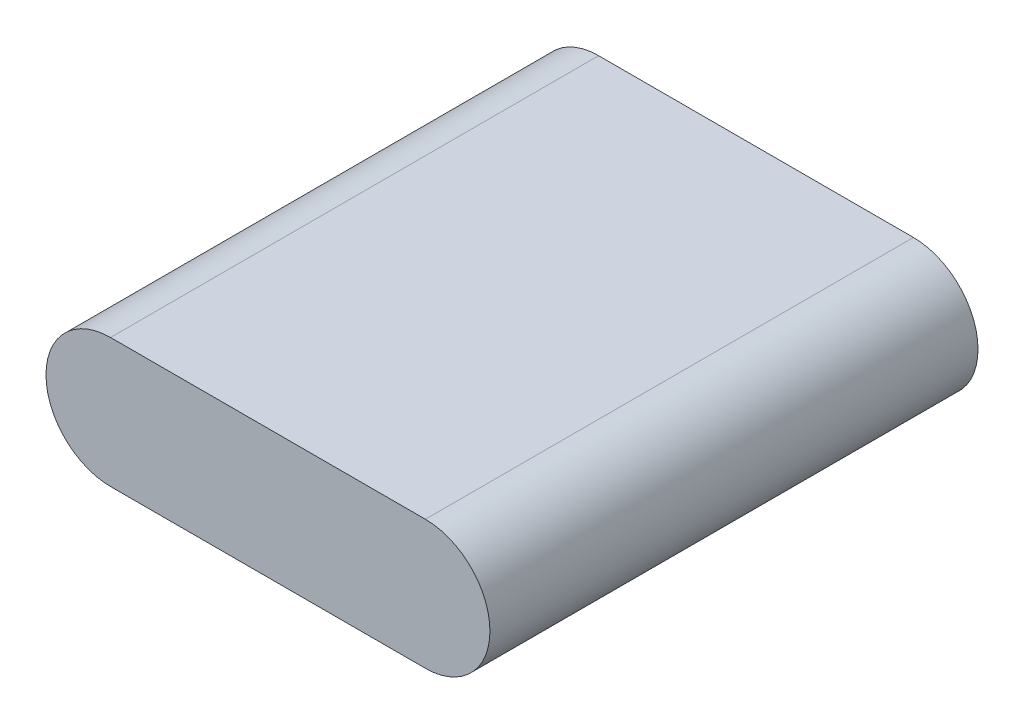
ISO-10303-21;
HEADER;
FILE_DESCRIPTION(('STEP AP214'),'2;1');
FILE_NAME('part.step','',(''),(''),'','','');
FILE_SCHEMA(('AUTOMOTIVE_DESIGN { 1 0 10303 214 1 1 1 1 }'));
ENDSEC;
DATA;
#1=APPLICATION_CONTEXT('core data for automotive mechanical design processes');
#2=APPLICATION_PROTOCOL_DEFINITION('international standard','automotive_design',2000,#1);
#3=PRODUCT_CONTEXT('',#1,'mechanical');
#4=PRODUCT('Part','Part','',(#3));
#5=PRODUCT_RELATED_PRODUCT_CATEGORY('part','',(#4));
#6=PRODUCT_DEFINITION_FORMATION('','',#4);
#7=PRODUCT_DEFINITION_CONTEXT('part definition',#1,'design');
#8=PRODUCT_DEFINITION('design','',#6,#7);
#9=PRODUCT_DEFINITION_SHAPE('','',#8);
#10=(LENGTH_UNIT() NAMED_UNIT(*) SI_UNIT(.MILLI.,.METRE.));
#11=(NAMED_UNIT(*) PLANE_ANGLE_UNIT() SI_UNIT($,.RADIAN.));
#12=(NAMED_UNIT(*) SI_UNIT($,.STERADIAN.) SOLID_ANGLE_UNIT());
#13=UNCERTAINTY_MEASURE_WITH_UNIT(LENGTH_MEASURE(1.E-05),#10,'distance_accuracy_value','');
#14=(GEOMETRIC_REPRESENTATION_CONTEXT(3) GLOBAL_UNCERTAINTY_ASSIGNED_CONTEXT((#13)) GLOBAL_UNIT_ASSIGNED_CONTEXT((#10,
#11,#12)) REPRESENTATION_CONTEXT('',''));
#15=CARTESIAN_POINT('',(0.,0.,0.));
#16=DIRECTION('',(0.,0.,1.));
#17=DIRECTION('',(1.,0.,0.));
#18=AXIS2_PLACEMENT_3D('',#15,#16,#17);
#19=CARTESIAN_POINT('',(-27.4447,0.,42.545));
#20=DIRECTION('',(0.,0.,-1.));
#21=DIRECTION('',(-1.,0.,0.));
#22=AXIS2_PLACEMENT_3D('',#19,#20,#21);
#23=CYLINDRICAL_SURFACE('',#22,11.2522);
#24=CARTESIAN_POINT('',(-27.4447,0.,-42.545));
#25=DIRECTION('',(0.,0.,1.));
#26=DIRECTION('',(1.,0.,0.));
#27=AXIS2_PLACEMENT_3D('',#24,#25,#26);
#28=CIRCLE('',#27,11.2522);
#29=CARTESIAN_POINT('',(-27.4447,11.2522,-42.545));
#30=VERTEX_POINT('',#29);
#31=CARTESIAN_POINT('',(-27.4447,-11.2522,-42.545));
#32=VERTEX_POINT('',#31);
#33=EDGE_CURVE('E97',#30,#32,#28,.T.);
#34=ORIENTED_EDGE('',*,*,#33,.T.);
#35=DIRECTION('',(0.,0.,-1.));
#36=VECTOR('',#35,1.);
#37=CARTESIAN_POINT('',(-27.4447,-11.2522,42.545));
#38=LINE('',#37,#36);
#39=CARTESIAN_POINT('',(-27.4447,-11.2522,42.545));
#40=VERTEX_POINT('',#39);
#41=EDGE_CURVE('E11',#40,#32,#38,.T.);
#42=ORIENTED_EDGE('',*,*,#41,.F.);
#43=CARTESIAN_POINT('',(-27.4447,0.,42.545));
#44=DIRECTION('',(0.,0.,1.));
#45=DIRECTION('',(1.,0.,0.));
#46=AXIS2_PLACEMENT_3D('',#43,#44,#45);
#47=CIRCLE('',#46,11.2522);
#48=CARTESIAN_POINT('',(-27.4447,11.2522,42.545));
#49=VERTEX_POINT('',#48);
#50=EDGE_CURVE('E85',#49,#40,#47,.T.);
#51=ORIENTED_EDGE('',*,*,#50,.F.);
#52=DIRECTION('',(0.,0.,-1.));
#53=VECTOR('',#52,1.);
#54=CARTESIAN_POINT('',(-27.4447,11.2522,42.545));
#55=LINE('',#54,#53);
#56=EDGE_CURVE('E93',#49,#30,#55,.T.);
#57=ORIENTED_EDGE('',*,*,#56,.T.);
#58=EDGE_LOOP('',(#34,#42,#51,#57));
#59=FACE_BOUND('',#58,.T.);
#60=ADVANCED_FACE('F34',(#59),#23,.T.);
#61=CARTESIAN_POINT('',(-27.4447,-11.2522,42.545));
#62=DIRECTION('',(0.,1.,0.));
#63=DIRECTION('',(-1.,0.,0.));
#64=AXIS2_PLACEMENT_3D('',#61,#62,#63);
#65=PLANE('',#64);
#66=DIRECTION('',(1.,0.,0.));
#67=VECTOR('',#66,1.);
#68=CARTESIAN_POINT('',(-27.4447,-11.2522,-42.545));
#69=LINE('',#68,#67);
#70=CARTESIAN_POINT('',(27.4447,-11.2522,-42.545));
#71=VERTEX_POINT('',#70);
#72=EDGE_CURVE('E89',#32,#71,#69,.T.);
#73=ORIENTED_EDGE('',*,*,#72,.T.);
#74=DIRECTION('',(0.,0.,-1.));
#75=VECTOR('',#74,1.);
#76=CARTESIAN_POINT('',(27.4447,-11.2522,42.545));
#77=LINE('',#76,#75);
#78=CARTESIAN_POINT('',(27.4447,-11.2522,42.545));
#79=VERTEX_POINT('',#78);
#80=EDGE_CURVE('E42',#79,#71,#77,.T.);
#81=ORIENTED_EDGE('',*,*,#80,.F.);
#82=DIRECTION('',(1.,0.,0.));
#83=VECTOR('',#82,1.);
#84=CARTESIAN_POINT('',(-27.4447,-11.2522,42.545));
#85=LINE('',#84,#83);
#86=EDGE_CURVE('E80',#40,#79,#85,.T.);
#87=ORIENTED_EDGE('',*,*,#86,.F.);
#88=ORIENTED_EDGE('',*,*,#41,.T.);
#89=EDGE_LOOP('',(#73,#81,#87,#88));
#90=FACE_BOUND('',#89,.T.);
#91=ADVANCED_FACE('F88',(#90),#65,.F.);
#92=CARTESIAN_POINT('',(27.4447,0.,42.545));
#93=DIRECTION('',(0.,0.,-1.));
#94=DIRECTION('',(-1.,0.,0.));
#95=AXIS2_PLACEMENT_3D('',#92,#93,#94);
#96=CYLINDRICAL_SURFACE('',#95,11.2522);
#97=CARTESIAN_POINT('',(27.4447,0.,-42.545));
#98=DIRECTION('',(0.,0.,1.));
#99=DIRECTION('',(1.,0.,0.));
#100=AXIS2_PLACEMENT_3D('',#97,#98,#99);
#101=CIRCLE('',#100,11.2522);
#102=CARTESIAN_POINT('',(27.4447,11.2522,-42.545));
#103=VERTEX_POINT('',#102);
#104=EDGE_CURVE('E67',#71,#103,#101,.T.);
#105=ORIENTED_EDGE('',*,*,#104,.T.);
#106=DIRECTION('',(0.,0.,-1.));
#107=VECTOR('',#106,1.);
#108=CARTESIAN_POINT('',(27.4447,11.2522,42.545));
#109=LINE('',#108,#107);
#110=CARTESIAN_POINT('',(27.4447,11.2522,42.545));
#111=VERTEX_POINT('',#110);
#112=EDGE_CURVE('E90',#111,#103,#109,.T.);
#113=ORIENTED_EDGE('',*,*,#112,.F.);
#114=CARTESIAN_POINT('',(27.4447,0.,42.545));
#115=DIRECTION('',(0.,0.,1.));
#116=DIRECTION('',(1.,0.,0.));
#117=AXIS2_PLACEMENT_3D('',#114,#115,#116);
#118=CIRCLE('',#117,11.2522);
#119=EDGE_CURVE('E83',#79,#111,#118,.T.);
#120=ORIENTED_EDGE('',*,*,#119,.F.);
#121=ORIENTED_EDGE('',*,*,#80,.T.);
#122=EDGE_LOOP('',(#105,#113,#120,#121));
#123=FACE_BOUND('',#122,.T.);
#124=ADVANCED_FACE('F91',(#123),#96,.T.);
#125=CARTESIAN_POINT('',(-27.4447,11.2522,42.545));
#126=DIRECTION('',(0.,-1.,0.));
#127=DIRECTION('',(1.,0.,0.));
#128=AXIS2_PLACEMENT_3D('',#125,#126,#127);
#129=PLANE('',#128);
#130=DIRECTION('',(-1.,0.,0.));
#131=VECTOR('',#130,1.);
#132=CARTESIAN_POINT('',(-27.4447,11.2522,-42.545));
#133=LINE('',#132,#131);
#134=EDGE_CURVE('E73',#103,#30,#133,.T.);
#135=ORIENTED_EDGE('',*,*,#134,.T.);
#136=ORIENTED_EDGE('',*,*,#56,.F.);
#137=DIRECTION('',(-1.,0.,0.));
#138=VECTOR('',#137,1.);
#139=CARTESIAN_POINT('',(-27.4447,11.2522,42.545));
#140=LINE('',#139,#138);
#141=EDGE_CURVE('E50',#111,#49,#140,.T.);
#142=ORIENTED_EDGE('',*,*,#141,.F.);
#143=ORIENTED_EDGE('',*,*,#112,.T.);
#144=EDGE_LOOP('',(#135,#136,#142,#143));
#145=FACE_BOUND('',#144,.T.);
#146=ADVANCED_FACE('F104',(#145),#129,.F.);
#147=CARTESIAN_POINT('',(-27.4447,0.,42.545));
#148=DIRECTION('',(0.,0.,1.));
#149=DIRECTION('',(1.,0.,0.));
#150=AXIS2_PLACEMENT_3D('',#147,#148,#149);
#151=PLANE('',#150);
#152=ORIENTED_EDGE('',*,*,#50,.T.);
#153=ORIENTED_EDGE('',*,*,#86,.T.);
#154=ORIENTED_EDGE('',*,*,#119,.T.);
#155=ORIENTED_EDGE('',*,*,#141,.T.);
#156=EDGE_LOOP('',(#152,#153,#154,#155));
#157=FACE_BOUND('',#156,.T.);
#158=ADVANCED_FACE('F81',(#157),#151,.T.);
#159=CARTESIAN_POINT('',(-27.4447,0.,-42.545));
#160=DIRECTION('',(0.,0.,1.));
#161=DIRECTION('',(1.,0.,0.));
#162=AXIS2_PLACEMENT_3D('',#159,#160,#161);
#163=PLANE('',#162);
#164=ORIENTED_EDGE('',*,*,#33,.F.);
#165=ORIENTED_EDGE('',*,*,#134,.F.);
#166=ORIENTED_EDGE('',*,*,#104,.F.);
#167=ORIENTED_EDGE('',*,*,#72,.F.);
#168=EDGE_LOOP('',(#164,#165,#166,#167));
#169=FACE_BOUND('',#168,.T.);
#170=ADVANCED_FACE('F107',(#169),#163,.F.);
#171=CLOSED_SHELL('',(#60,#91,#124,#146,#158,#170));
#172=MANIFOLD_SOLID_BREP('B2',#171);
#173=ADVANCED_BREP_SHAPE_REPRESENTATION('',(#18,#172),#14);
#174=SHAPE_DEFINITION_REPRESENTATION(#9,#173);
ENDSEC;
END-ISO-10303-21;
